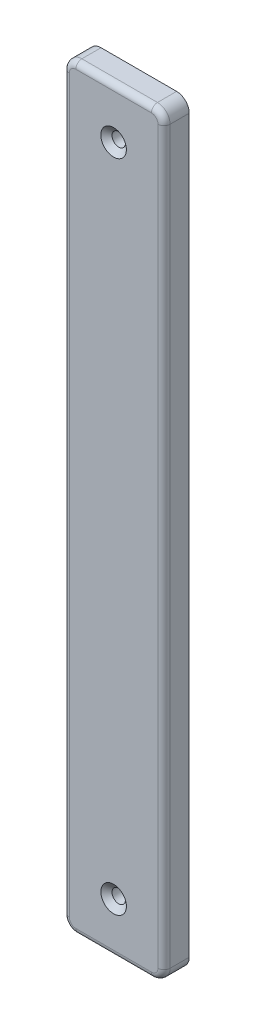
from build123d import *

# Parameters (mm, degrees)
SKETCH1_W                                           = 50.8
SKETCH1_H                                           = 381
BASE_EXTRUDE_DEPTH                                  = 12.7
CSK_FOR_1_4_FLAT_HEAD_MACHINE_SCREW_100_D           = 6.7564
CSK_FOR_1_4_FLAT_HEAD_MACHINE_SCREW_100_CSINK_D     = 12.8778
CSK_FOR_1_4_FLAT_HEAD_MACHINE_SCREW_100_CSINK_ANGLE = 100
FILLET1_R                                           = 6.35
FILLET2_R                                           = 3.048


with BuildPart() as part:
    # Sketch1 → Base-Extrude (new body)
    with BuildSketch(Plane.XY):
        Rectangle(SKETCH1_W, SKETCH1_H)
    extrude(amount=BASE_EXTRUDE_DEPTH)

    # CSK for 1_4 Flat Head Machine Screw _100 (through all)
    with Locations(Plane.XY.offset(12.7)):
        with Locations((0, 165.1), (0, -165.1)):
            CounterSinkHole(CSK_FOR_1_4_FLAT_HEAD_MACHINE_SCREW_100_D / 2, CSK_FOR_1_4_FLAT_HEAD_MACHINE_SCREW_100_CSINK_D / 2, counter_sink_angle=CSK_FOR_1_4_FLAT_HEAD_MACHINE_SCREW_100_CSINK_ANGLE)

    # Fillet1
    fillet1_edges = [part.edges().sort_by_distance(p)[0] for p in [
        (25.4, -190.5, 6.35),
        (-25.4, -190.5, 6.35),
        (-25.4, 190.5, 6.35),
        (25.4, 190.5, 6.35),
    ]]
    fillet(fillet1_edges, radius=FILLET1_R)

    # Fillet2
    fillet2_edges = [part.edges().sort_by_distance(p)[0] for p in [
        (25.4, 0, 12.7),
        (0, -190.5, 12.7),
        (0, 190.5, 12.7),
        (-25.4, 0, 12.7),
        (23.540128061, 188.640128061, 12.7),
        (-23.540128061, 188.640128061, 12.7),
        (-23.540128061, -188.640128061, 12.7),
        (23.540128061, -188.640128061, 12.7),
    ]]
    fillet(fillet2_edges, radius=FILLET2_R)


solid = part.part
